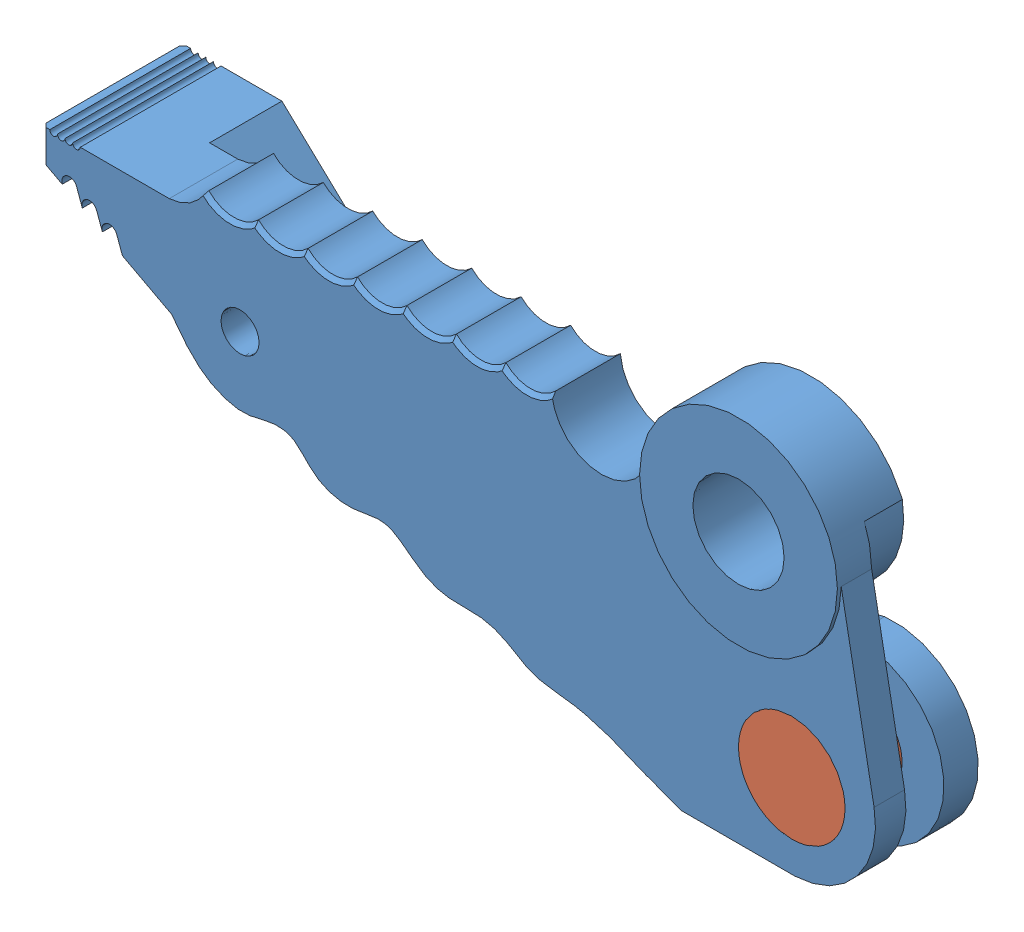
SolidWorks assembly Lame.SLDASM, configuration Défaut (file format 4700). Lengths in mm.
Overall size (219.02 98 38).
3 component instances, 3 part files, 4 mates.
Components (placement in the parent):
- Lame-1: Lame.SLDPRT [Défaut] at (59.5801 16.7215 0) size (219.02 98 38)
- AxeEpaule-1: AxeEpaule.SLDPRT [Défaut] at (72.5801 -33.2785 18) x (0 0 1) z (-1 0 0) size (30 28 28)
- anneau_elastique_pour_arbre_o22_-_uni_7435-1: anneau_elastique_pour_arbre_o22_-_uni_7435.SLDPRT [Default] at (72.5801 -33.2785 -10.2) size (23.6 27.66 1.2)
Mates (geometry in assembly coordinates):
- Coaxiale1: concentric: cylinder of Lame-1 through (72.5801 -33.2785 -19) axis (0 0 1) radius 11; cylinder of AxeEpaule-1 through (72.5801 -33.2785 -12) axis (0 0 -1) radius 11
- Coïncidente1: coincident anti-aligned: plane of Lame-1 through (72.5801 -33.2785 16) normal (0 0 1); plane of AxeEpaule-1 through (72.5801 -19.2785 16) normal (0 0 -1)
- Coïncidente2: coincident: plane of AxeEpaule-1 through (72.5801 -22.2785 -9) normal (0 0 -1); plane of anneau_elastique_pour_arbre_o22_-_uni_7435-1 through (72.5801 -33.2785 -9) normal (0 0 1)
- Coaxiale2: concentric aligned: cylinder of AxeEpaule-1 through (72.5801 -33.2785 -12) axis (0 0 -1) radius 10.5; cylinder of anneau_elastique_pour_arbre_o22_-_uni_7435-1 through (72.5801 -33.2785 -9) axis (0 0 -1) radius 10.5
